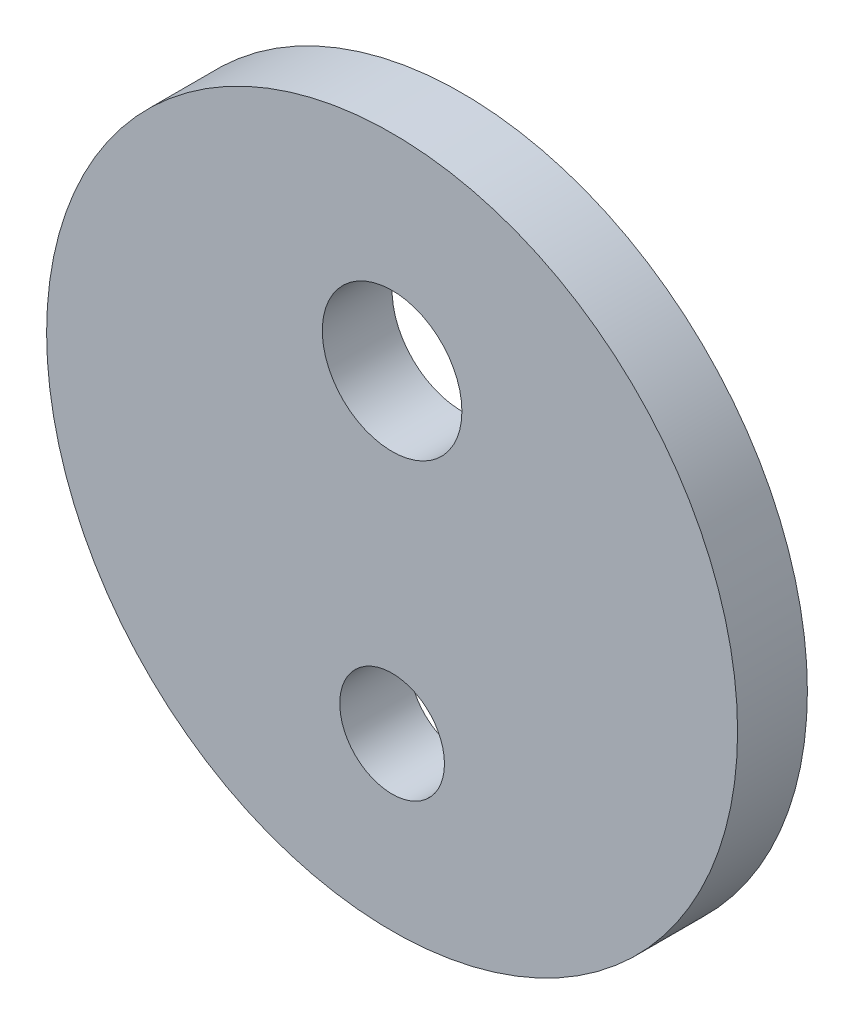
from build123d import *

# Parameters (mm, degrees)
SKETCH1_R      = 49.497474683
SKETCH1_R_2    = 10
SKETCH1_R_3    = 7.5
EXTRUDE1_DEPTH = 10


with BuildPart() as part:
    # Sketch1 → Extrude1 (new body)
    with BuildSketch(Plane.XY):
        Circle(SKETCH1_R)
        with Locations((0, 20)):
            Circle(SKETCH1_R_2, mode=Mode.SUBTRACT)
        with Locations((0, -25)):
            Circle(SKETCH1_R_3, mode=Mode.SUBTRACT)
    extrude(amount=EXTRUDE1_DEPTH)


solid = part.part
